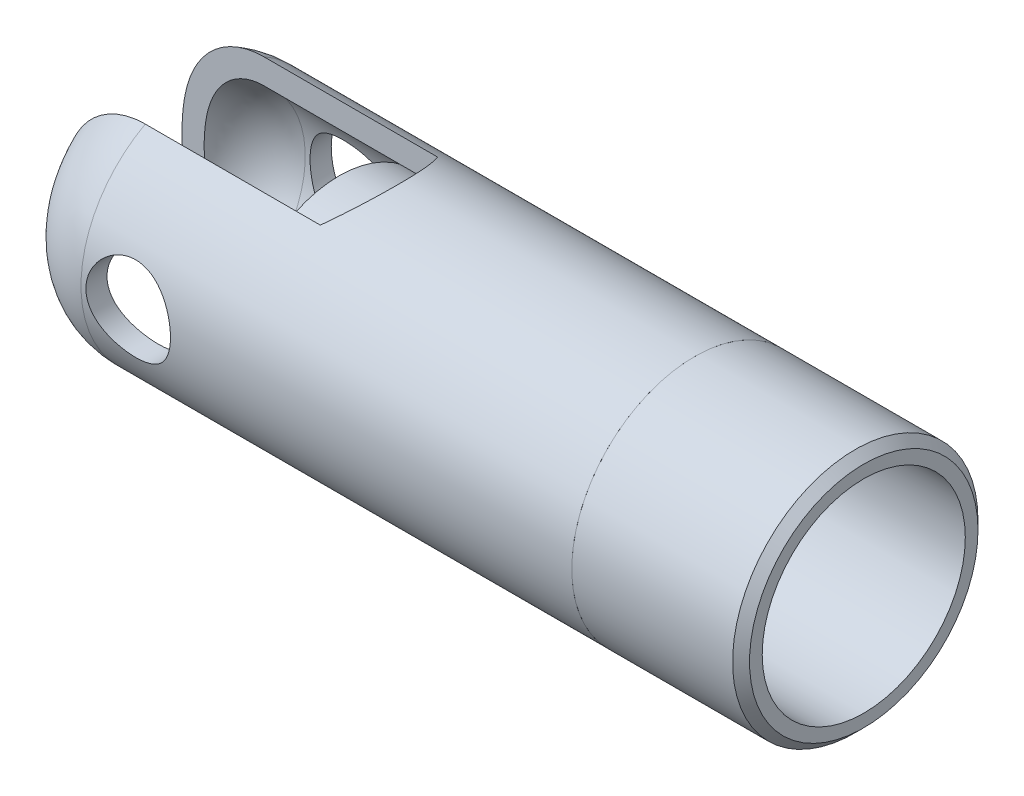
from build123d import *

# Parameters (mm, degrees)
CROQUIS1_R              = 7.25
CROQUIS1_R_2            = 6
SALIENTE_EXTRUIR1_DEPTH = 10
CHAFL_N1_SIZE           = 0.5
CROQUIS2_R              = 6
SALIENTE_EXTRUIR2_DEPTH = 21
CROQUIS3_R              = 7.25
SALIENTE_EXTRUIR4_DEPTH = 34
REDONDEO1_R             = 5
VACIADO1_T              = -1.25
CORTAR_EXTRUIR1_DEPTH   = 17
CROQUIS6_R              = 2.5
CORTAR_EXTRUIR2_DEPTH   = 17


with BuildPart() as part:
    # Croquis1 → Saliente-Extruir1 (new body)
    with BuildSketch(Plane(origin=(0, 0, 0), x_dir=(0, 0, -1), z_dir=(1, 0, 0))):
        Circle(CROQUIS1_R)
        Circle(CROQUIS1_R_2, mode=Mode.SUBTRACT)
    extrude(amount=-SALIENTE_EXTRUIR1_DEPTH)

    # Chafl_n1
    chafl_n1_edges = [part.edges().sort_by_distance(p)[0] for p in [
        (0, 0, 7.25),
    ]]
    chamfer(chafl_n1_edges, length=CHAFL_N1_SIZE)


with BuildPart() as body_2:
    # Croquis2 → Saliente-Extruir2 (new body)
    with BuildSketch(Plane.ZY.offset(10)):
        with Locations(Location((0, 0, 0), (0, 0, 180))):
            Circle(CROQUIS2_R)
    extrude(amount=SALIENTE_EXTRUIR2_DEPTH)


with BuildPart() as body_3:
    # Croquis3 → Saliente-Extruir4 (new body)
    with BuildSketch(Plane.ZY.offset(10)):
        Circle(CROQUIS3_R)
    extrude(amount=SALIENTE_EXTRUIR4_DEPTH)

    # Redondeo1
    redondeo1_edges = [body_3.edges().sort_by_distance(p)[0] for p in [
        (-44, 0, -7.25),
    ]]
    fillet(redondeo1_edges, radius=REDONDEO1_R)

    # Vaciado1
    vaciado1_openings = [body_3.faces().sort_by_distance(p)[0] for p in [
        (-10, 0, 0),
    ]]
    offset(amount=VACIADO1_T, openings=vaciado1_openings, kind=Kind.INTERSECTION)

    # Croquis5 → Cortar-Extruir1 (cut, symmetric)
    with BuildSketch(Plane(origin=(0, 0, 0), x_dir=(1, 0, 0), z_dir=(0, 1, 0))):
        with BuildLine():
            Line((-44, 3.545784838), (-28.722313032, 3.545784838))
            ThreePointArc((-28.722313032, 3.545784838), (-27.562768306, 0.056741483), (-28.656117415, -3.453608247))
            Line((-28.656117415, -3.453608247), (-44, -3.453608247))
            Line((-44, -3.453608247), (-44, 3.545784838))
        make_face()
    extrude(amount=CORTAR_EXTRUIR1_DEPTH, both=True, mode=Mode.SUBTRACT)

    # Croquis6 → Cortar-Extruir2 (cut, symmetric)
    with BuildSketch(Plane.XY):
        with Locations((-36.215143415, 0)):
            Circle(CROQUIS6_R)
    extrude(amount=CORTAR_EXTRUIR2_DEPTH, both=True, mode=Mode.SUBTRACT)


solid = Compound([part.part, body_2.part, body_3.part])
